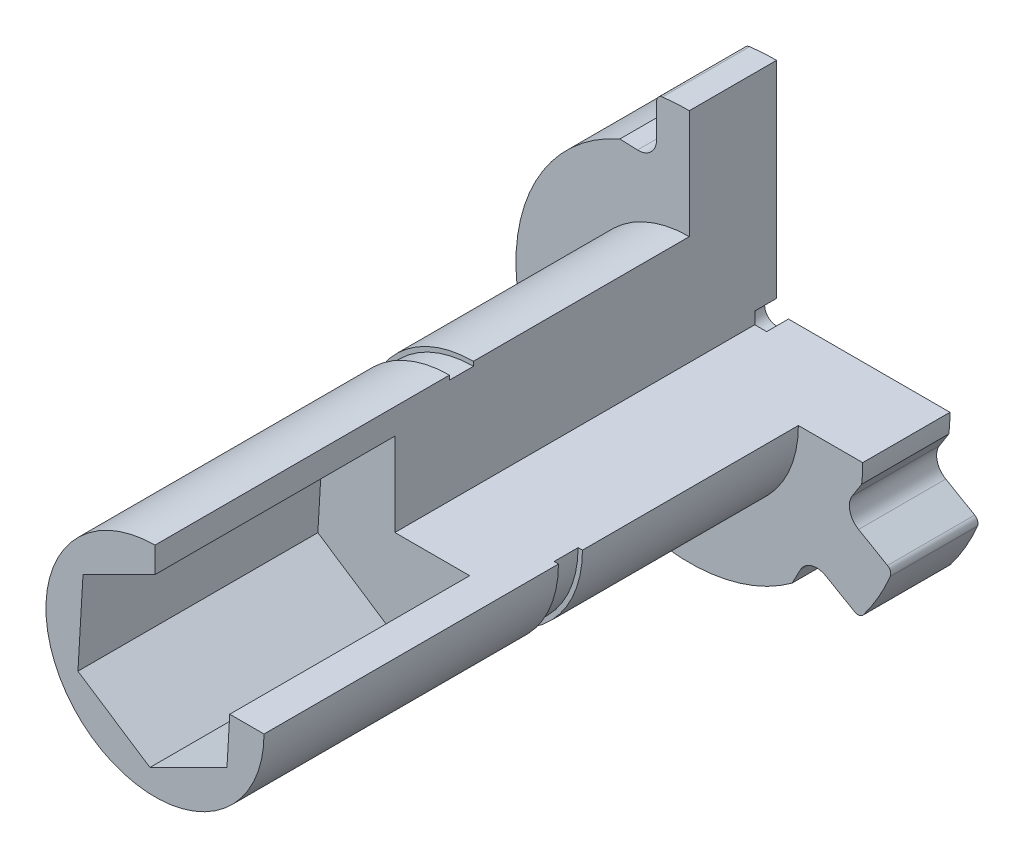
from build123d import *

# Parameters (mm, degrees)
ESQUISSE1_R              = 5
EXTRUSION1_DEPTH         = 24.5
ENL_V_MAT_EXTRU_1_DEPTH  = 11
ESQUISSE4_R              = 10
EXTRUSION2_DEPTH         = 4
ESQUISSE5_OUTSIDE_W      = 30.03
ESQUISSE5_OUTSIDE_H      = 30.03
ENL_V_MAT_EXTRU_3_DEPTH  = 32.81587654
ESQUISSE6_R              = 0.545651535
ENL_V_MAT_EXTRU_4_DEPTH  = 1
CONG_2_R                 = 0.3
ENL_V_START              = -1.1
ESQUISSE21_R             = 5
ESQUISSE21_R_2           = 4.8
ENL_V_MAT_EXTRU_11_DEPTH = 1.1
ESQUISSE22_W             = 32.535634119
ESQUISSE22_H             = 11.349830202
ENL_V_MAT_EXTRU_12_DEPTH = 30


with BuildPart() as part:
    # Esquisse1 → Extrusion1 (new body)
    with BuildSketch(Plane.XY):
        Circle(ESQUISSE1_R)
    extrude(amount=EXTRUSION1_DEPTH)

    # Esquisse2 → Enl_v. mat.-Extru.1 (cut)
    with BuildSketch(Plane.XY.offset(24.5)):
        Polygon((3.300533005, -2.17302173), (3.532158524, 1.771834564), (0.231625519, 3.944856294), (-3.300533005, 2.17302173), (-3.532158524, -1.771834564), (-0.231625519, -3.944856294), align=None)
    extrude(amount=-ENL_V_MAT_EXTRU_1_DEPTH, mode=Mode.SUBTRACT)

    # Esquisse4 → Extrusion2 (add)
    with BuildSketch(Plane(origin=(0, 0, 0), x_dir=(-1, 0, 0), z_dir=(0, 0, -1))):
        Circle(ESQUISSE4_R)
    extrude(amount=EXTRUSION2_DEPTH)

    # Esquisse5 outside → Enl_v. mat.-Extru.3 (cut, through all)
    with BuildSketch(Plane(origin=(0, 0, -4), x_dir=(-1, 0, 0), z_dir=(0, 0, -1))):
        Rectangle(ESQUISSE5_OUTSIDE_W, ESQUISSE5_OUTSIDE_H)
        with BuildLine():
            Line((-2.376594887, 7.251291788), (-3.18515413, 7.284043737))
            ThreePointArc((-3.18515413, 7.284043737), (-6.88490196, 3.975), (-7.900743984, -0.883597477))
            Line((-7.900743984, -0.883597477), (-7.468100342, -1.567454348))
            ThreePointArc((-7.468100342, -1.567454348), (-7.362040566, -2.219425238), (-7.758828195, -2.747510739))
            Line((-7.758828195, -2.747510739), (-9.312271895, -3.644391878))
            ThreePointArc((-9.312271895, -3.644391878), (-8.660254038, -5), (-7.812271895, -6.242468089))
            Line((-7.812271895, -6.242468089), (-6.258828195, -5.345586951))
            ThreePointArc((-6.258828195, -5.345586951), (-5.603098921, -5.266001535), (-5.091505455, -5.68383744))
            Line((-5.091505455, -5.68383744), (-4.715589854, -6.40044626))
            ThreePointArc((-4.715589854, -6.40044626), (0, -7.95), (4.715589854, -6.40044626))
            Line((4.715589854, -6.40044626), (5.091505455, -5.68383744))
            ThreePointArc((5.091505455, -5.68383744), (5.603098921, -5.266001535), (6.258828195, -5.345586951))
            Line((6.258828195, -5.345586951), (7.812271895, -6.242468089))
            ThreePointArc((7.812271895, -6.242468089), (8.660254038, -5), (9.312271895, -3.644391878))
            Line((9.312271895, -3.644391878), (7.758828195, -2.747510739))
            ThreePointArc((7.758828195, -2.747510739), (7.362040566, -2.219425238), (7.468100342, -1.567454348))
            Line((7.468100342, -1.567454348), (7.900743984, -0.883597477))
            ThreePointArc((7.900743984, -0.883597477), (6.88490196, 3.975), (3.18515413, 7.284043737))
            Line((3.18515413, 7.284043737), (2.376594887, 7.251291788))
            ThreePointArc((2.376594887, 7.251291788), (1.758941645, 7.485426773), (1.5, 8.09309769))
            Line((1.5, 8.09309769), (1.5, 9.886859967))
            ThreePointArc((1.5, 9.886859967), (0, 10), (-1.5, 9.886859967))
            Line((-1.5, 9.886859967), (-1.5, 8.09309769))
            ThreePointArc((-1.5, 8.09309769), (-1.758941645, 7.485426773), (-2.376594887, 7.251291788))
        make_face(mode=Mode.SUBTRACT)
    extrude(amount=-ENL_V_MAT_EXTRU_3_DEPTH, mode=Mode.SUBTRACT)

    # Esquisse6 → Enl_v. mat.-Extru.4 (cut)
    with BuildSketch(Plane(origin=(0, 0, -4), x_dir=(-1, 0, 0), z_dir=(0, 0, -1))):
        Circle(ESQUISSE6_R)
    extrude(amount=-ENL_V_MAT_EXTRU_4_DEPTH, mode=Mode.SUBTRACT)

    # Cong_2
    cong_2_edges = [part.edges().sort_by_distance(p)[0] for p in [
        (7.812271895, -6.242468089, -2),
        (9.312271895, -3.644391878, -2),
        (1.5, 9.886859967, -2),
        (-1.5, 9.886859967, -2),
        (-9.312271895, -3.644391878, -2),
        (-7.812271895, -6.242468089, -2),
    ]]
    fillet(cong_2_edges, radius=CONG_2_R)

    # Esquisse21 → Enl_v. mat.-Extru.11 (cut)
    with BuildSketch(Plane.XY.offset(11).offset(ENL_V_START)):
        with Locations(Location((0, 0, 0), (0, 0, 180))):
            Circle(ESQUISSE21_R)
        Circle(ESQUISSE21_R_2, mode=Mode.SUBTRACT)
    extrude(amount=ENL_V_MAT_EXTRU_11_DEPTH, mode=Mode.SUBTRACT)

    # Esquisse22 → Enl_v. mat.-Extru.12 (cut)
    with BuildSketch(Plane(origin=(0, 0, 0), x_dir=(0, 0, -1), z_dir=(1, 0, 0))):
        with Locations((-10.068742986, 5.674915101)):
            Rectangle(ESQUISSE22_W, ESQUISSE22_H)
    extrude(amount=ENL_V_MAT_EXTRU_12_DEPTH, mode=Mode.SUBTRACT)


solid = part.part
